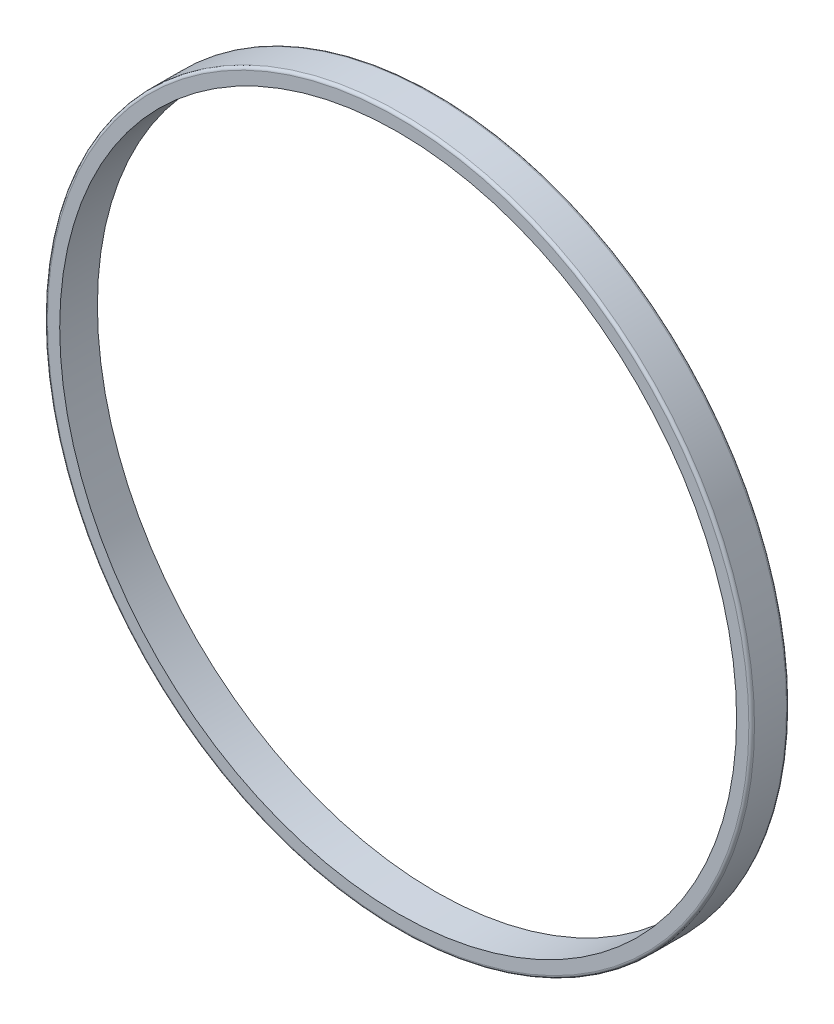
ISO-10303-21;
HEADER;
FILE_DESCRIPTION(('STEP AP214'),'2;1');
FILE_NAME('part.step','',(''),(''),'','','');
FILE_SCHEMA(('AUTOMOTIVE_DESIGN { 1 0 10303 214 1 1 1 1 }'));
ENDSEC;
DATA;
#1=APPLICATION_CONTEXT('core data for automotive mechanical design processes');
#2=APPLICATION_PROTOCOL_DEFINITION('international standard','automotive_design',2000,#1);
#3=PRODUCT_CONTEXT('',#1,'mechanical');
#4=PRODUCT('Part','Part','',(#3));
#5=PRODUCT_RELATED_PRODUCT_CATEGORY('part','',(#4));
#6=PRODUCT_DEFINITION_FORMATION('','',#4);
#7=PRODUCT_DEFINITION_CONTEXT('part definition',#1,'design');
#8=PRODUCT_DEFINITION('design','',#6,#7);
#9=PRODUCT_DEFINITION_SHAPE('','',#8);
#10=(LENGTH_UNIT() NAMED_UNIT(*) SI_UNIT(.MILLI.,.METRE.));
#11=(NAMED_UNIT(*) PLANE_ANGLE_UNIT() SI_UNIT($,.RADIAN.));
#12=(NAMED_UNIT(*) SI_UNIT($,.STERADIAN.) SOLID_ANGLE_UNIT());
#13=UNCERTAINTY_MEASURE_WITH_UNIT(LENGTH_MEASURE(1.E-05),#10,'distance_accuracy_value','');
#14=(GEOMETRIC_REPRESENTATION_CONTEXT(3) GLOBAL_UNCERTAINTY_ASSIGNED_CONTEXT((#13)) GLOBAL_UNIT_ASSIGNED_CONTEXT((#10,
#11,#12)) REPRESENTATION_CONTEXT('',''));
#15=CARTESIAN_POINT('',(0.,0.,0.));
#16=DIRECTION('',(0.,0.,1.));
#17=DIRECTION('',(1.,0.,0.));
#18=AXIS2_PLACEMENT_3D('',#15,#16,#17);
#19=CARTESIAN_POINT('',(0.,0.,4.));
#20=DIRECTION('',(0.,0.,1.));
#21=DIRECTION('',(1.,0.,0.));
#22=AXIS2_PLACEMENT_3D('',#19,#20,#21);
#23=PLANE('',#22);
#24=CARTESIAN_POINT('',(0.,0.,4.));
#25=DIRECTION('',(0.,0.,1.));
#26=DIRECTION('',(1.,0.,0.));
#27=AXIS2_PLACEMENT_3D('',#24,#25,#26);
#28=CIRCLE('',#27,37.2);
#29=CARTESIAN_POINT('',(37.2,0.,4.));
#30=VERTEX_POINT('',#29);
#31=EDGE_CURVE('E10',#30,#30,#28,.T.);
#32=ORIENTED_EDGE('',*,*,#31,.T.);
#33=EDGE_LOOP('',(#32));
#34=FACE_BOUND('',#33,.T.);
#35=CARTESIAN_POINT('',(0.,0.,4.));
#36=DIRECTION('',(0.,0.,1.));
#37=DIRECTION('',(1.,0.,0.));
#38=AXIS2_PLACEMENT_3D('',#35,#36,#37);
#39=CIRCLE('',#38,35.9);
#40=CARTESIAN_POINT('',(35.9,0.,4.));
#41=VERTEX_POINT('',#40);
#42=EDGE_CURVE('E53',#41,#41,#39,.T.);
#43=ORIENTED_EDGE('',*,*,#42,.F.);
#44=EDGE_LOOP('',(#43));
#45=FACE_BOUND('',#44,.T.);
#46=ADVANCED_FACE('F33',(#34,#45),#23,.T.);
#47=CARTESIAN_POINT('',(0.,0.,0.));
#48=DIRECTION('',(0.,0.,1.));
#49=DIRECTION('',(1.,0.,0.));
#50=AXIS2_PLACEMENT_3D('',#47,#48,#49);
#51=PLANE('',#50);
#52=CARTESIAN_POINT('',(0.,0.,0.));
#53=DIRECTION('',(0.,0.,1.));
#54=DIRECTION('',(1.,0.,0.));
#55=AXIS2_PLACEMENT_3D('',#52,#53,#54);
#56=CIRCLE('',#55,37.2);
#57=CARTESIAN_POINT('',(37.2,0.,0.));
#58=VERTEX_POINT('',#57);
#59=EDGE_CURVE('E40',#58,#58,#56,.F.);
#60=ORIENTED_EDGE('',*,*,#59,.T.);
#61=EDGE_LOOP('',(#60));
#62=FACE_BOUND('',#61,.T.);
#63=CARTESIAN_POINT('',(0.,0.,0.));
#64=DIRECTION('',(0.,0.,1.));
#65=DIRECTION('',(1.,0.,0.));
#66=AXIS2_PLACEMENT_3D('',#63,#64,#65);
#67=CIRCLE('',#66,35.9);
#68=CARTESIAN_POINT('',(35.9,0.,0.));
#69=VERTEX_POINT('',#68);
#70=EDGE_CURVE('E54',#69,#69,#67,.T.);
#71=ORIENTED_EDGE('',*,*,#70,.T.);
#72=EDGE_LOOP('',(#71));
#73=FACE_BOUND('',#72,.T.);
#74=ADVANCED_FACE('F64',(#62,#73),#51,.F.);
#75=CARTESIAN_POINT('',(0.,0.,4.));
#76=DIRECTION('',(0.,0.,-1.));
#77=DIRECTION('',(-1.,0.,0.));
#78=AXIS2_PLACEMENT_3D('',#75,#76,#77);
#79=CYLINDRICAL_SURFACE('',#78,37.5);
#80=CARTESIAN_POINT('',(0.,0.,0.3));
#81=DIRECTION('',(0.,0.,1.));
#82=DIRECTION('',(1.,0.,0.));
#83=AXIS2_PLACEMENT_3D('',#80,#81,#82);
#84=CIRCLE('',#83,37.5);
#85=CARTESIAN_POINT('',(37.5,0.,0.3));
#86=VERTEX_POINT('',#85);
#87=EDGE_CURVE('E44',#86,#86,#84,.T.);
#88=ORIENTED_EDGE('',*,*,#87,.T.);
#89=EDGE_LOOP('',(#88));
#90=FACE_BOUND('',#89,.T.);
#91=CARTESIAN_POINT('',(0.,0.,3.7));
#92=DIRECTION('',(0.,0.,1.));
#93=DIRECTION('',(1.,0.,0.));
#94=AXIS2_PLACEMENT_3D('',#91,#92,#93);
#95=CIRCLE('',#94,37.5);
#96=CARTESIAN_POINT('',(37.5,0.,3.7));
#97=VERTEX_POINT('',#96);
#98=EDGE_CURVE('E48',#97,#97,#95,.F.);
#99=ORIENTED_EDGE('',*,*,#98,.T.);
#100=EDGE_LOOP('',(#99));
#101=FACE_BOUND('',#100,.T.);
#102=ADVANCED_FACE('F69',(#90,#101),#79,.T.);
#103=CARTESIAN_POINT('',(0.,0.,4.));
#104=DIRECTION('',(0.,0.,-1.));
#105=DIRECTION('',(-1.,0.,0.));
#106=AXIS2_PLACEMENT_3D('',#103,#104,#105);
#107=CYLINDRICAL_SURFACE('',#106,35.9);
#108=ORIENTED_EDGE('',*,*,#42,.T.);
#109=EDGE_LOOP('',(#108));
#110=FACE_BOUND('',#109,.T.);
#111=ORIENTED_EDGE('',*,*,#70,.F.);
#112=EDGE_LOOP('',(#111));
#113=FACE_BOUND('',#112,.T.);
#114=ADVANCED_FACE('F60',(#110,#113),#107,.F.);
#115=CARTESIAN_POINT('',(0.,0.,0.3));
#116=DIRECTION('',(0.,0.,1.));
#117=DIRECTION('',(1.,0.,0.));
#118=AXIS2_PLACEMENT_3D('',#115,#116,#117);
#119=TOROIDAL_SURFACE('',#118,37.2,0.3);
#120=ORIENTED_EDGE('',*,*,#59,.F.);
#121=EDGE_LOOP('',(#120));
#122=FACE_BOUND('',#121,.T.);
#123=ORIENTED_EDGE('',*,*,#87,.F.);
#124=EDGE_LOOP('',(#123));
#125=FACE_BOUND('',#124,.T.);
#126=ADVANCED_FACE('F75',(#122,#125),#119,.T.);
#127=CARTESIAN_POINT('',(0.,0.,3.7));
#128=DIRECTION('',(0.,0.,1.));
#129=DIRECTION('',(1.,0.,0.));
#130=AXIS2_PLACEMENT_3D('',#127,#128,#129);
#131=TOROIDAL_SURFACE('',#130,37.2,0.3);
#132=ORIENTED_EDGE('',*,*,#98,.F.);
#133=EDGE_LOOP('',(#132));
#134=FACE_BOUND('',#133,.T.);
#135=ORIENTED_EDGE('',*,*,#31,.F.);
#136=EDGE_LOOP('',(#135));
#137=FACE_BOUND('',#136,.T.);
#138=ADVANCED_FACE('F35',(#134,#137),#131,.T.);
#139=CLOSED_SHELL('',(#46,#74,#102,#114,#126,#138));
#140=MANIFOLD_SOLID_BREP('B2',#139);
#141=ADVANCED_BREP_SHAPE_REPRESENTATION('',(#18,#140),#14);
#142=SHAPE_DEFINITION_REPRESENTATION(#9,#141);
ENDSEC;
END-ISO-10303-21;
